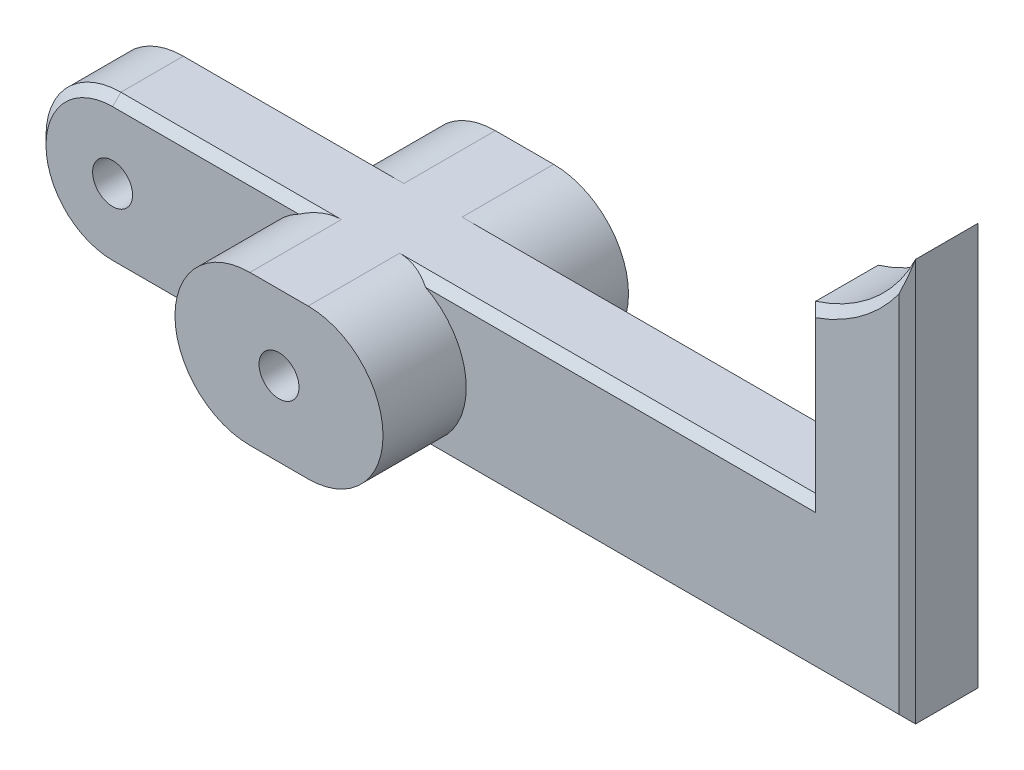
ISO-10303-21;
HEADER;
FILE_DESCRIPTION(('STEP AP214'),'2;1');
FILE_NAME('part.step','',(''),(''),'','','');
FILE_SCHEMA(('AUTOMOTIVE_DESIGN { 1 0 10303 214 1 1 1 1 }'));
ENDSEC;
DATA;
#1=APPLICATION_CONTEXT('core data for automotive mechanical design processes');
#2=APPLICATION_PROTOCOL_DEFINITION('international standard','automotive_design',2000,#1);
#3=PRODUCT_CONTEXT('',#1,'mechanical');
#4=PRODUCT('Part','Part','',(#3));
#5=PRODUCT_RELATED_PRODUCT_CATEGORY('part','',(#4));
#6=PRODUCT_DEFINITION_FORMATION('','',#4);
#7=PRODUCT_DEFINITION_CONTEXT('part definition',#1,'design');
#8=PRODUCT_DEFINITION('design','',#6,#7);
#9=PRODUCT_DEFINITION_SHAPE('','',#8);
#10=(LENGTH_UNIT() NAMED_UNIT(*) SI_UNIT(.MILLI.,.METRE.));
#11=(NAMED_UNIT(*) PLANE_ANGLE_UNIT() SI_UNIT($,.RADIAN.));
#12=(NAMED_UNIT(*) SI_UNIT($,.STERADIAN.) SOLID_ANGLE_UNIT());
#13=UNCERTAINTY_MEASURE_WITH_UNIT(LENGTH_MEASURE(1.E-05),#10,'distance_accuracy_value','');
#14=(GEOMETRIC_REPRESENTATION_CONTEXT(3) GLOBAL_UNCERTAINTY_ASSIGNED_CONTEXT((#13)) GLOBAL_UNIT_ASSIGNED_CONTEXT((#10,
#11,#12)) REPRESENTATION_CONTEXT('',''));
#15=CARTESIAN_POINT('',(0.,0.,0.));
#16=DIRECTION('',(0.,0.,1.));
#17=DIRECTION('',(1.,0.,0.));
#18=AXIS2_PLACEMENT_3D('',#15,#16,#17);
#19=CARTESIAN_POINT('',(96.5,67.0787840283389,4.75));
#20=DIRECTION('',(0.,0.,1.));
#21=DIRECTION('',(1.,0.,0.));
#22=AXIS2_PLACEMENT_3D('',#19,#20,#21);
#23=PLANE('',#22);
#24=CARTESIAN_POINT('',(19.,19.,4.75));
#25=DIRECTION('',(0.,0.,1.));
#26=DIRECTION('',(1.,0.,0.));
#27=AXIS2_PLACEMENT_3D('',#24,#25,#26);
#28=CIRCLE('',#27,2.4);
#29=CARTESIAN_POINT('',(21.4,19.,4.75));
#30=VERTEX_POINT('',#29);
#31=EDGE_CURVE('E264',#30,#30,#28,.T.);
#32=ORIENTED_EDGE('',*,*,#31,.F.);
#33=EDGE_LOOP('',(#32));
#34=FACE_BOUND('',#33,.T.);
#35=DIRECTION('',(1.,0.,0.));
#36=VECTOR('',#35,1.);
#37=CARTESIAN_POINT('',(114.5,11.,4.75));
#38=LINE('',#37,#36);
#39=CARTESIAN_POINT('',(19.,11.,4.75));
#40=VERTEX_POINT('',#39);
#41=CARTESIAN_POINT('',(41.3768943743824,11.,4.75));
#42=VERTEX_POINT('',#41);
#43=EDGE_CURVE('E359',#40,#42,#38,.T.);
#44=ORIENTED_EDGE('',*,*,#43,.T.);
#45=CARTESIAN_POINT('',(45.5,19.,4.75));
#46=DIRECTION('',(0.,0.,1.));
#47=DIRECTION('',(1.,0.,0.));
#48=AXIS2_PLACEMENT_3D('',#45,#46,#47);
#49=CIRCLE('',#48,9.);
#50=CARTESIAN_POINT('',(41.3768943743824,27.,4.75));
#51=VERTEX_POINT('',#50);
#52=EDGE_CURVE('E249',#42,#51,#49,.F.);
#53=ORIENTED_EDGE('',*,*,#52,.T.);
#54=DIRECTION('',(-1.,0.,0.));
#55=VECTOR('',#54,1.);
#56=CARTESIAN_POINT('',(19.,27.,4.75));
#57=LINE('',#56,#55);
#58=CARTESIAN_POINT('',(19.,27.,4.75));
#59=VERTEX_POINT('',#58);
#60=EDGE_CURVE('E344',#51,#59,#57,.T.);
#61=ORIENTED_EDGE('',*,*,#60,.T.);
#62=CARTESIAN_POINT('',(19.,19.,4.75));
#63=DIRECTION('',(0.,0.,1.));
#64=DIRECTION('',(1.,0.,0.));
#65=AXIS2_PLACEMENT_3D('',#62,#63,#64);
#66=CIRCLE('',#65,8.00000000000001);
#67=CARTESIAN_POINT('',(11.,19.,4.75));
#68=VERTEX_POINT('',#67);
#69=EDGE_CURVE('E354',#59,#68,#66,.T.);
#70=ORIENTED_EDGE('',*,*,#69,.T.);
#71=CARTESIAN_POINT('',(19.,19.,4.75));
#72=DIRECTION('',(0.,0.,1.));
#73=DIRECTION('',(1.,0.,0.));
#74=AXIS2_PLACEMENT_3D('',#71,#72,#73);
#75=CIRCLE('',#74,8.00000000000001);
#76=EDGE_CURVE('E356',#68,#40,#75,.T.);
#77=ORIENTED_EDGE('',*,*,#76,.T.);
#78=EDGE_LOOP('',(#44,#53,#61,#70,#77));
#79=FACE_BOUND('',#78,.T.);
#80=ADVANCED_FACE('F36',(#34,#79),#23,.T.);
#81=CARTESIAN_POINT('',(103.5,27.,4.75));
#82=VERTEX_POINT('',#81);
#83=CARTESIAN_POINT('',(56.6231056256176,27.,4.75));
#84=VERTEX_POINT('',#83);
#85=EDGE_CURVE('E345',#82,#84,#57,.T.);
#86=ORIENTED_EDGE('',*,*,#85,.T.);
#87=CARTESIAN_POINT('',(52.5,19.,4.75));
#88=DIRECTION('',(0.,0.,1.));
#89=DIRECTION('',(1.,0.,0.));
#90=AXIS2_PLACEMENT_3D('',#87,#88,#89);
#91=CIRCLE('',#90,9.);
#92=CARTESIAN_POINT('',(56.6231056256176,11.,4.75));
#93=VERTEX_POINT('',#92);
#94=EDGE_CURVE('E232',#84,#93,#91,.F.);
#95=ORIENTED_EDGE('',*,*,#94,.T.);
#96=CARTESIAN_POINT('',(113.5,11.,4.75));
#97=VERTEX_POINT('',#96);
#98=EDGE_CURVE('E358',#93,#97,#38,.T.);
#99=ORIENTED_EDGE('',*,*,#98,.T.);
#100=DIRECTION('',(0.,1.,0.));
#101=VECTOR('',#100,1.);
#102=CARTESIAN_POINT('',(113.5,58.3609861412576,4.75));
#103=LINE('',#102,#101);
#104=CARTESIAN_POINT('',(113.5,54.749956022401,4.75));
#105=VERTEX_POINT('',#104);
#106=EDGE_CURVE('E352',#97,#105,#103,.T.);
#107=ORIENTED_EDGE('',*,*,#106,.T.);
#108=CARTESIAN_POINT('',(96.5,67.0787840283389,4.75));
#109=DIRECTION('',(0.,0.,1.));
#110=DIRECTION('',(1.,0.,0.));
#111=AXIS2_PLACEMENT_3D('',#108,#109,#110);
#112=CIRCLE('',#111,21.);
#113=CARTESIAN_POINT('',(103.5,47.2797941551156,4.75));
#114=VERTEX_POINT('',#113);
#115=EDGE_CURVE('E350',#105,#114,#112,.F.);
#116=ORIENTED_EDGE('',*,*,#115,.T.);
#117=DIRECTION('',(0.,-1.,0.));
#118=VECTOR('',#117,1.);
#119=CARTESIAN_POINT('',(103.5,28.,4.75));
#120=LINE('',#119,#118);
#121=EDGE_CURVE('E348',#114,#82,#120,.T.);
#122=ORIENTED_EDGE('',*,*,#121,.T.);
#123=EDGE_LOOP('',(#86,#95,#99,#107,#116,#122));
#124=FACE_BOUND('',#123,.T.);
#125=ADVANCED_FACE('F496',(#124),#23,.T.);
#126=CARTESIAN_POINT('',(96.5,67.0787840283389,-4.75));
#127=DIRECTION('',(0.,0.,1.));
#128=DIRECTION('',(1.,0.,0.));
#129=AXIS2_PLACEMENT_3D('',#126,#127,#128);
#130=PLANE('',#129);
#131=CARTESIAN_POINT('',(19.,19.,-4.75));
#132=DIRECTION('',(0.,0.,1.));
#133=DIRECTION('',(1.,0.,0.));
#134=AXIS2_PLACEMENT_3D('',#131,#132,#133);
#135=CIRCLE('',#134,2.4);
#136=CARTESIAN_POINT('',(21.4,19.,-4.75));
#137=VERTEX_POINT('',#136);
#138=EDGE_CURVE('E268',#137,#137,#135,.T.);
#139=ORIENTED_EDGE('',*,*,#138,.T.);
#140=EDGE_LOOP('',(#139));
#141=FACE_BOUND('',#140,.T.);
#142=CARTESIAN_POINT('',(45.5,19.,-4.75));
#143=DIRECTION('',(0.,0.,1.));
#144=DIRECTION('',(1.,0.,0.));
#145=AXIS2_PLACEMENT_3D('',#142,#143,#144);
#146=CIRCLE('',#145,9.);
#147=CARTESIAN_POINT('',(41.3768943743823,11.,-4.75));
#148=VERTEX_POINT('',#147);
#149=CARTESIAN_POINT('',(41.3768943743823,27.,-4.75));
#150=VERTEX_POINT('',#149);
#151=EDGE_CURVE('E258',#148,#150,#146,.F.);
#152=ORIENTED_EDGE('',*,*,#151,.F.);
#153=DIRECTION('',(-1.,0.,0.));
#154=VECTOR('',#153,1.);
#155=CARTESIAN_POINT('',(96.5,11.,-4.75));
#156=LINE('',#155,#154);
#157=CARTESIAN_POINT('',(19.,11.,-4.75));
#158=VERTEX_POINT('',#157);
#159=EDGE_CURVE('E312',#148,#158,#156,.T.);
#160=ORIENTED_EDGE('',*,*,#159,.T.);
#161=CARTESIAN_POINT('',(19.,19.,-4.75));
#162=DIRECTION('',(0.,0.,1.));
#163=DIRECTION('',(1.,0.,0.));
#164=AXIS2_PLACEMENT_3D('',#161,#162,#163);
#165=CIRCLE('',#164,8.);
#166=CARTESIAN_POINT('',(11.,19.,-4.75));
#167=VERTEX_POINT('',#166);
#168=EDGE_CURVE('E310',#158,#167,#165,.F.);
#169=ORIENTED_EDGE('',*,*,#168,.T.);
#170=CARTESIAN_POINT('',(19.,19.,-4.75));
#171=DIRECTION('',(0.,0.,1.));
#172=DIRECTION('',(1.,0.,0.));
#173=AXIS2_PLACEMENT_3D('',#170,#171,#172);
#174=CIRCLE('',#173,8.);
#175=CARTESIAN_POINT('',(19.,27.,-4.75));
#176=VERTEX_POINT('',#175);
#177=EDGE_CURVE('E308',#167,#176,#174,.F.);
#178=ORIENTED_EDGE('',*,*,#177,.T.);
#179=DIRECTION('',(1.,0.,0.));
#180=VECTOR('',#179,1.);
#181=CARTESIAN_POINT('',(96.5,27.,-4.75));
#182=LINE('',#181,#180);
#183=EDGE_CURVE('E299',#176,#150,#182,.T.);
#184=ORIENTED_EDGE('',*,*,#183,.T.);
#185=EDGE_LOOP('',(#152,#160,#169,#178,#184));
#186=FACE_BOUND('',#185,.T.);
#187=ADVANCED_FACE('F557',(#141,#186),#130,.F.);
#188=CARTESIAN_POINT('',(52.5,19.,-4.75));
#189=DIRECTION('',(0.,0.,1.));
#190=DIRECTION('',(1.,0.,0.));
#191=AXIS2_PLACEMENT_3D('',#188,#189,#190);
#192=CIRCLE('',#191,9.);
#193=CARTESIAN_POINT('',(56.6231056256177,27.,-4.75));
#194=VERTEX_POINT('',#193);
#195=CARTESIAN_POINT('',(56.6231056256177,11.,-4.75));
#196=VERTEX_POINT('',#195);
#197=EDGE_CURVE('E52',#194,#196,#192,.F.);
#198=ORIENTED_EDGE('',*,*,#197,.F.);
#199=CARTESIAN_POINT('',(103.5,27.,-4.75));
#200=VERTEX_POINT('',#199);
#201=EDGE_CURVE('E298',#194,#200,#182,.T.);
#202=ORIENTED_EDGE('',*,*,#201,.T.);
#203=DIRECTION('',(0.,1.,0.));
#204=VECTOR('',#203,1.);
#205=CARTESIAN_POINT('',(103.5,67.0787840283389,-4.75));
#206=LINE('',#205,#204);
#207=CARTESIAN_POINT('',(103.5,47.2797941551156,-4.75));
#208=VERTEX_POINT('',#207);
#209=EDGE_CURVE('E302',#200,#208,#206,.T.);
#210=ORIENTED_EDGE('',*,*,#209,.T.);
#211=CARTESIAN_POINT('',(96.5,67.0787840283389,-4.75));
#212=DIRECTION('',(0.,0.,1.));
#213=DIRECTION('',(1.,0.,0.));
#214=AXIS2_PLACEMENT_3D('',#211,#212,#213);
#215=CIRCLE('',#214,21.);
#216=CARTESIAN_POINT('',(113.5,54.749956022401,-4.75));
#217=VERTEX_POINT('',#216);
#218=EDGE_CURVE('E304',#208,#217,#215,.T.);
#219=ORIENTED_EDGE('',*,*,#218,.T.);
#220=DIRECTION('',(0.,-1.,0.));
#221=VECTOR('',#220,1.);
#222=CARTESIAN_POINT('',(113.5,67.0787840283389,-4.75));
#223=LINE('',#222,#221);
#224=CARTESIAN_POINT('',(113.5,11.,-4.75));
#225=VERTEX_POINT('',#224);
#226=EDGE_CURVE('E306',#217,#225,#223,.T.);
#227=ORIENTED_EDGE('',*,*,#226,.T.);
#228=EDGE_CURVE('E313',#225,#196,#156,.T.);
#229=ORIENTED_EDGE('',*,*,#228,.T.);
#230=EDGE_LOOP('',(#198,#202,#210,#219,#227,#229));
#231=FACE_BOUND('',#230,.T.);
#232=ADVANCED_FACE('F566',(#231),#130,.F.);
#233=CARTESIAN_POINT('',(10.,28.,-3.75));
#234=DIRECTION('',(0.,-0.707106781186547,0.707106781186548));
#235=DIRECTION('',(-1.,0.,0.));
#236=AXIS2_PLACEMENT_3D('',#233,#234,#235);
#237=PLANE('',#236);
#238=DIRECTION('',(-1.,0.,0.));
#239=VECTOR('',#238,1.);
#240=CARTESIAN_POINT('',(10.,28.,-3.75));
#241=LINE('',#240,#239);
#242=CARTESIAN_POINT('',(45.5,28.,-3.75));
#243=VERTEX_POINT('',#242);
#244=CARTESIAN_POINT('',(19.,28.,-3.75));
#245=VERTEX_POINT('',#244);
#246=EDGE_CURVE('E340',#243,#245,#241,.T.);
#247=ORIENTED_EDGE('',*,*,#246,.F.);
#248=CARTESIAN_POINT('',(45.5,19.,-12.75));
#249=DIRECTION('',(0.,-0.707106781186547,0.707106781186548));
#250=DIRECTION('',(0.,-0.707106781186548,-0.707106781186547));
#251=AXIS2_PLACEMENT_3D('',#248,#249,#250);
#252=ELLIPSE('',#251,12.7279220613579,9.);
#253=EDGE_CURVE('E260',#243,#150,#252,.T.);
#254=ORIENTED_EDGE('',*,*,#253,.T.);
#255=ORIENTED_EDGE('',*,*,#183,.F.);
#256=DIRECTION('',(0.,-0.707106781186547,-0.707106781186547));
#257=VECTOR('',#256,1.);
#258=CARTESIAN_POINT('',(19.,28.,-3.75));
#259=LINE('',#258,#257);
#260=EDGE_CURVE('E419',#245,#176,#259,.T.);
#261=ORIENTED_EDGE('',*,*,#260,.F.);
#262=EDGE_LOOP('',(#247,#254,#255,#261));
#263=FACE_BOUND('',#262,.T.);
#264=ADVANCED_FACE('F604',(#263),#237,.F.);
#265=ORIENTED_EDGE('',*,*,#201,.F.);
#266=CARTESIAN_POINT('',(52.5,19.,-12.75));
#267=DIRECTION('',(0.,-0.707106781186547,0.707106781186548));
#268=DIRECTION('',(0.,-0.707106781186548,-0.707106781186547));
#269=AXIS2_PLACEMENT_3D('',#266,#267,#268);
#270=ELLIPSE('',#269,12.7279220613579,9.);
#271=CARTESIAN_POINT('',(52.5,28.,-3.75));
#272=VERTEX_POINT('',#271);
#273=EDGE_CURVE('E246',#194,#272,#270,.T.);
#274=ORIENTED_EDGE('',*,*,#273,.T.);
#275=CARTESIAN_POINT('',(102.5,28.,-3.75));
#276=VERTEX_POINT('',#275);
#277=EDGE_CURVE('E341',#276,#272,#241,.T.);
#278=ORIENTED_EDGE('',*,*,#277,.F.);
#279=DIRECTION('',(0.577350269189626,-0.577350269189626,-0.577350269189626));
#280=VECTOR('',#279,1.);
#281=CARTESIAN_POINT('',(95.8333333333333,34.6666666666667,2.91666666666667));
#282=LINE('',#281,#280);
#283=EDGE_CURVE('E292',#200,#276,#282,.F.);
#284=ORIENTED_EDGE('',*,*,#283,.F.);
#285=EDGE_LOOP('',(#265,#274,#278,#284));
#286=FACE_BOUND('',#285,.T.);
#287=ADVANCED_FACE('F597',(#286),#237,.F.);
#288=CARTESIAN_POINT('',(10.,10.,-3.75));
#289=DIRECTION('',(0.,0.707106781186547,0.707106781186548));
#290=DIRECTION('',(1.,0.,0.));
#291=AXIS2_PLACEMENT_3D('',#288,#289,#290);
#292=PLANE('',#291);
#293=ORIENTED_EDGE('',*,*,#159,.F.);
#294=CARTESIAN_POINT('',(45.5,19.,-12.75));
#295=DIRECTION('',(0.,0.707106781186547,0.707106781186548));
#296=DIRECTION('',(0.,0.707106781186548,-0.707106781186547));
#297=AXIS2_PLACEMENT_3D('',#294,#295,#296);
#298=ELLIPSE('',#297,12.7279220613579,9.);
#299=CARTESIAN_POINT('',(45.5,10.,-3.75000000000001));
#300=VERTEX_POINT('',#299);
#301=EDGE_CURVE('E255',#148,#300,#298,.T.);
#302=ORIENTED_EDGE('',*,*,#301,.T.);
#303=DIRECTION('',(1.,0.,0.));
#304=VECTOR('',#303,1.);
#305=CARTESIAN_POINT('',(10.,10.,-3.75));
#306=LINE('',#305,#304);
#307=CARTESIAN_POINT('',(19.,10.,-3.75));
#308=VERTEX_POINT('',#307);
#309=EDGE_CURVE('E296',#308,#300,#306,.T.);
#310=ORIENTED_EDGE('',*,*,#309,.F.);
#311=DIRECTION('',(0.,0.707106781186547,-0.707106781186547));
#312=VECTOR('',#311,1.);
#313=CARTESIAN_POINT('',(19.,10.,-3.75));
#314=LINE('',#313,#312);
#315=EDGE_CURVE('E365',#308,#158,#314,.T.);
#316=ORIENTED_EDGE('',*,*,#315,.T.);
#317=EDGE_LOOP('',(#293,#302,#310,#316));
#318=FACE_BOUND('',#317,.T.);
#319=ADVANCED_FACE('F593',(#318),#292,.F.);
#320=CARTESIAN_POINT('',(96.5,27.,4.75));
#321=DIRECTION('',(0.,0.707106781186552,0.707106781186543));
#322=DIRECTION('',(1.,0.,0.));
#323=AXIS2_PLACEMENT_3D('',#320,#321,#322);
#324=PLANE('',#323);
#325=ORIENTED_EDGE('',*,*,#60,.F.);
#326=CARTESIAN_POINT('',(45.5,19.,12.7500000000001));
#327=DIRECTION('',(0.,0.707106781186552,0.707106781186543));
#328=DIRECTION('',(0.,0.707106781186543,-0.707106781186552));
#329=AXIS2_PLACEMENT_3D('',#326,#327,#328);
#330=ELLIPSE('',#329,12.7279220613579,9.);
#331=CARTESIAN_POINT('',(45.5,28.,3.75));
#332=VERTEX_POINT('',#331);
#333=EDGE_CURVE('E252',#51,#332,#330,.F.);
#334=ORIENTED_EDGE('',*,*,#333,.T.);
#335=DIRECTION('',(1.,0.,0.));
#336=VECTOR('',#335,1.);
#337=CARTESIAN_POINT('',(102.5,28.,3.75));
#338=LINE('',#337,#336);
#339=CARTESIAN_POINT('',(19.,28.,3.75));
#340=VERTEX_POINT('',#339);
#341=EDGE_CURVE('E337',#340,#332,#338,.T.);
#342=ORIENTED_EDGE('',*,*,#341,.F.);
#343=DIRECTION('',(0.,0.707106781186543,-0.707106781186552));
#344=VECTOR('',#343,1.);
#345=CARTESIAN_POINT('',(19.,27.,4.75));
#346=LINE('',#345,#344);
#347=EDGE_CURVE('E476',#59,#340,#346,.T.);
#348=ORIENTED_EDGE('',*,*,#347,.F.);
#349=EDGE_LOOP('',(#325,#334,#342,#348));
#350=FACE_BOUND('',#349,.T.);
#351=ADVANCED_FACE('F39',(#350),#324,.T.);
#352=CARTESIAN_POINT('',(52.5,28.,3.75));
#353=VERTEX_POINT('',#352);
#354=CARTESIAN_POINT('',(102.5,28.,3.75));
#355=VERTEX_POINT('',#354);
#356=EDGE_CURVE('E336',#353,#355,#338,.T.);
#357=ORIENTED_EDGE('',*,*,#356,.F.);
#358=CARTESIAN_POINT('',(52.5,19.,12.7500000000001));
#359=DIRECTION('',(0.,0.707106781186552,0.707106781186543));
#360=DIRECTION('',(0.,0.707106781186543,-0.707106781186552));
#361=AXIS2_PLACEMENT_3D('',#358,#359,#360);
#362=ELLIPSE('',#361,12.7279220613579,9.);
#363=EDGE_CURVE('E236',#353,#84,#362,.F.);
#364=ORIENTED_EDGE('',*,*,#363,.T.);
#365=ORIENTED_EDGE('',*,*,#85,.F.);
#366=DIRECTION('',(-0.577350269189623,0.577350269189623,-0.577350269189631));
#367=VECTOR('',#366,1.);
#368=CARTESIAN_POINT('',(90.1404053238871,40.3595946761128,-8.60959467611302));
#369=LINE('',#368,#367);
#370=EDGE_CURVE('E366',#355,#82,#369,.F.);
#371=ORIENTED_EDGE('',*,*,#370,.F.);
#372=EDGE_LOOP('',(#357,#364,#365,#371));
#373=FACE_BOUND('',#372,.T.);
#374=ADVANCED_FACE('F506',(#373),#324,.T.);
#375=CARTESIAN_POINT('',(96.5,11.,4.75));
#376=DIRECTION('',(0.,-0.707106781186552,0.707106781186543));
#377=DIRECTION('',(-1.,0.,0.));
#378=AXIS2_PLACEMENT_3D('',#375,#376,#377);
#379=PLANE('',#378);
#380=DIRECTION('',(-1.,0.,0.));
#381=VECTOR('',#380,1.);
#382=CARTESIAN_POINT('',(19.,10.,3.75));
#383=LINE('',#382,#381);
#384=CARTESIAN_POINT('',(45.5,10.,3.75));
#385=VERTEX_POINT('',#384);
#386=CARTESIAN_POINT('',(19.,10.,3.75));
#387=VERTEX_POINT('',#386);
#388=EDGE_CURVE('E289',#385,#387,#383,.T.);
#389=ORIENTED_EDGE('',*,*,#388,.F.);
#390=CARTESIAN_POINT('',(45.5,19.,12.7500000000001));
#391=DIRECTION('',(0.,-0.707106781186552,0.707106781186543));
#392=DIRECTION('',(0.,-0.707106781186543,-0.707106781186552));
#393=AXIS2_PLACEMENT_3D('',#390,#391,#392);
#394=ELLIPSE('',#393,12.7279220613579,9.);
#395=EDGE_CURVE('E11',#385,#42,#394,.F.);
#396=ORIENTED_EDGE('',*,*,#395,.T.);
#397=ORIENTED_EDGE('',*,*,#43,.F.);
#398=DIRECTION('',(0.,-0.707106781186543,-0.707106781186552));
#399=VECTOR('',#398,1.);
#400=CARTESIAN_POINT('',(19.,11.,4.75));
#401=LINE('',#400,#399);
#402=EDGE_CURVE('E426',#40,#387,#401,.T.);
#403=ORIENTED_EDGE('',*,*,#402,.T.);
#404=EDGE_LOOP('',(#389,#396,#397,#403));
#405=FACE_BOUND('',#404,.T.);
#406=ADVANCED_FACE('F549',(#405),#379,.T.);
#407=CARTESIAN_POINT('',(10.,10.,4.75));
#408=DIRECTION('',(0.,1.,0.));
#409=DIRECTION('',(-1.,0.,0.));
#410=AXIS2_PLACEMENT_3D('',#407,#408,#409);
#411=PLANE('',#410);
#412=ORIENTED_EDGE('',*,*,#309,.T.);
#413=DIRECTION('',(0.,0.,-1.));
#414=VECTOR('',#413,1.);
#415=CARTESIAN_POINT('',(45.5,10.,14.75));
#416=LINE('',#415,#414);
#417=CARTESIAN_POINT('',(45.5,10.,-14.75));
#418=VERTEX_POINT('',#417);
#419=EDGE_CURVE('E233',#300,#418,#416,.T.);
#420=ORIENTED_EDGE('',*,*,#419,.T.);
#421=DIRECTION('',(1.,0.,0.));
#422=VECTOR('',#421,1.);
#423=CARTESIAN_POINT('',(45.5,10.,-14.75));
#424=LINE('',#423,#422);
#425=CARTESIAN_POINT('',(52.5,10.,-14.75));
#426=VERTEX_POINT('',#425);
#427=EDGE_CURVE('E525',#418,#426,#424,.T.);
#428=ORIENTED_EDGE('',*,*,#427,.T.);
#429=DIRECTION('',(0.,0.,-1.));
#430=VECTOR('',#429,1.);
#431=CARTESIAN_POINT('',(52.5,10.,14.75));
#432=LINE('',#431,#430);
#433=CARTESIAN_POINT('',(52.5,10.,-3.75));
#434=VERTEX_POINT('',#433);
#435=EDGE_CURVE('E514',#434,#426,#432,.T.);
#436=ORIENTED_EDGE('',*,*,#435,.F.);
#437=CARTESIAN_POINT('',(114.5,10.,-3.75));
#438=VERTEX_POINT('',#437);
#439=EDGE_CURVE('E295',#434,#438,#306,.T.);
#440=ORIENTED_EDGE('',*,*,#439,.T.);
#441=DIRECTION('',(0.,0.,-1.));
#442=VECTOR('',#441,1.);
#443=CARTESIAN_POINT('',(114.5,10.,4.75));
#444=LINE('',#443,#442);
#445=CARTESIAN_POINT('',(114.5,10.,3.75));
#446=VERTEX_POINT('',#445);
#447=EDGE_CURVE('E280',#446,#438,#444,.T.);
#448=ORIENTED_EDGE('',*,*,#447,.F.);
#449=CARTESIAN_POINT('',(52.5,10.,3.75));
#450=VERTEX_POINT('',#449);
#451=EDGE_CURVE('E293',#446,#450,#383,.T.);
#452=ORIENTED_EDGE('',*,*,#451,.T.);
#453=CARTESIAN_POINT('',(52.5,10.,14.75));
#454=VERTEX_POINT('',#453);
#455=EDGE_CURVE('E60',#454,#450,#432,.T.);
#456=ORIENTED_EDGE('',*,*,#455,.F.);
#457=DIRECTION('',(1.,0.,0.));
#458=VECTOR('',#457,1.);
#459=CARTESIAN_POINT('',(45.5,10.,14.75));
#460=LINE('',#459,#458);
#461=CARTESIAN_POINT('',(45.5,10.,14.75));
#462=VERTEX_POINT('',#461);
#463=EDGE_CURVE('E210',#462,#454,#460,.T.);
#464=ORIENTED_EDGE('',*,*,#463,.F.);
#465=EDGE_CURVE('E215',#462,#385,#416,.T.);
#466=ORIENTED_EDGE('',*,*,#465,.T.);
#467=ORIENTED_EDGE('',*,*,#388,.T.);
#468=DIRECTION('',(0.,0.,-1.));
#469=VECTOR('',#468,1.);
#470=CARTESIAN_POINT('',(19.,10.,4.75));
#471=LINE('',#470,#469);
#472=EDGE_CURVE('E283',#387,#308,#471,.T.);
#473=ORIENTED_EDGE('',*,*,#472,.T.);
#474=EDGE_LOOP('',(#412,#420,#428,#436,#440,#448,#452,#456,#464,#466,#467,#473));
#475=FACE_BOUND('',#474,.T.);
#476=ADVANCED_FACE('F213',(#475),#411,.F.);
#477=CARTESIAN_POINT('',(114.5,58.3609861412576,4.75));
#478=DIRECTION('',(-1.,0.,0.));
#479=DIRECTION('',(0.,0.,1.));
#480=AXIS2_PLACEMENT_3D('',#477,#478,#479);
#481=PLANE('',#480);
#482=ORIENTED_EDGE('',*,*,#447,.T.);
#483=DIRECTION('',(0.,1.,0.));
#484=VECTOR('',#483,1.);
#485=CARTESIAN_POINT('',(114.5,58.3609861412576,-3.75));
#486=LINE('',#485,#484);
#487=CARTESIAN_POINT('',(114.5,58.3609861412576,-3.75));
#488=VERTEX_POINT('',#487);
#489=EDGE_CURVE('E326',#438,#488,#486,.T.);
#490=ORIENTED_EDGE('',*,*,#489,.T.);
#491=DIRECTION('',(0.,0.,-1.));
#492=VECTOR('',#491,1.);
#493=CARTESIAN_POINT('',(114.5,58.3609861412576,4.75));
#494=LINE('',#493,#492);
#495=CARTESIAN_POINT('',(114.5,58.3609861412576,3.75));
#496=VERTEX_POINT('',#495);
#497=EDGE_CURVE('E277',#496,#488,#494,.T.);
#498=ORIENTED_EDGE('',*,*,#497,.F.);
#499=DIRECTION('',(0.,-1.,0.));
#500=VECTOR('',#499,1.);
#501=CARTESIAN_POINT('',(114.5,10.,3.75));
#502=LINE('',#501,#500);
#503=EDGE_CURVE('E324',#496,#446,#502,.T.);
#504=ORIENTED_EDGE('',*,*,#503,.T.);
#505=EDGE_LOOP('',(#482,#490,#498,#504));
#506=FACE_BOUND('',#505,.T.);
#507=ADVANCED_FACE('F488',(#506),#481,.F.);
#508=CARTESIAN_POINT('',(96.5,67.0787840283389,4.75));
#509=DIRECTION('',(0.,0.,-1.));
#510=DIRECTION('',(-1.,0.,0.));
#511=AXIS2_PLACEMENT_3D('',#508,#509,#510);
#512=CYLINDRICAL_SURFACE('',#511,20.);
#513=ORIENTED_EDGE('',*,*,#497,.T.);
#514=CARTESIAN_POINT('',(96.5,67.0787840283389,-3.75));
#515=DIRECTION('',(0.,0.,1.));
#516=DIRECTION('',(1.,0.,0.));
#517=AXIS2_PLACEMENT_3D('',#514,#515,#516);
#518=CIRCLE('',#517,20.);
#519=CARTESIAN_POINT('',(102.5,48.,-3.75));
#520=VERTEX_POINT('',#519);
#521=EDGE_CURVE('E330',#488,#520,#518,.F.);
#522=ORIENTED_EDGE('',*,*,#521,.T.);
#523=DIRECTION('',(0.,0.,-1.));
#524=VECTOR('',#523,1.);
#525=CARTESIAN_POINT('',(102.5,48.,4.75));
#526=LINE('',#525,#524);
#527=CARTESIAN_POINT('',(102.5,48.,3.75));
#528=VERTEX_POINT('',#527);
#529=EDGE_CURVE('E274',#528,#520,#526,.T.);
#530=ORIENTED_EDGE('',*,*,#529,.F.);
#531=CARTESIAN_POINT('',(96.5,67.0787840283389,3.75));
#532=DIRECTION('',(0.,0.,1.));
#533=DIRECTION('',(1.,0.,0.));
#534=AXIS2_PLACEMENT_3D('',#531,#532,#533);
#535=CIRCLE('',#534,20.);
#536=EDGE_CURVE('E328',#528,#496,#535,.T.);
#537=ORIENTED_EDGE('',*,*,#536,.T.);
#538=EDGE_LOOP('',(#513,#522,#530,#537));
#539=FACE_BOUND('',#538,.T.);
#540=ADVANCED_FACE('F573',(#539),#512,.F.);
#541=CARTESIAN_POINT('',(102.5,48.,4.75));
#542=DIRECTION('',(1.,0.,0.));
#543=DIRECTION('',(0.,0.,-1.));
#544=AXIS2_PLACEMENT_3D('',#541,#542,#543);
#545=PLANE('',#544);
#546=ORIENTED_EDGE('',*,*,#529,.T.);
#547=DIRECTION('',(0.,-1.,0.));
#548=VECTOR('',#547,1.);
#549=CARTESIAN_POINT('',(102.5,48.,-3.75));
#550=LINE('',#549,#548);
#551=EDGE_CURVE('E334',#520,#276,#550,.T.);
#552=ORIENTED_EDGE('',*,*,#551,.T.);
#553=DIRECTION('',(0.,0.,-1.));
#554=VECTOR('',#553,1.);
#555=CARTESIAN_POINT('',(102.5,28.,4.75));
#556=LINE('',#555,#554);
#557=EDGE_CURVE('E267',#355,#276,#556,.T.);
#558=ORIENTED_EDGE('',*,*,#557,.F.);
#559=DIRECTION('',(0.,1.,0.));
#560=VECTOR('',#559,1.);
#561=CARTESIAN_POINT('',(102.5,48.,3.75));
#562=LINE('',#561,#560);
#563=EDGE_CURVE('E332',#355,#528,#562,.T.);
#564=ORIENTED_EDGE('',*,*,#563,.T.);
#565=EDGE_LOOP('',(#546,#552,#558,#564));
#566=FACE_BOUND('',#565,.T.);
#567=ADVANCED_FACE('F570',(#566),#545,.F.);
#568=CARTESIAN_POINT('',(10.,28.,4.75));
#569=DIRECTION('',(0.,-1.,0.));
#570=DIRECTION('',(1.,0.,0.));
#571=AXIS2_PLACEMENT_3D('',#568,#569,#570);
#572=PLANE('',#571);
#573=ORIENTED_EDGE('',*,*,#277,.T.);
#574=DIRECTION('',(0.,0.,-1.));
#575=VECTOR('',#574,1.);
#576=CARTESIAN_POINT('',(52.5,28.,14.75));
#577=LINE('',#576,#575);
#578=CARTESIAN_POINT('',(52.5,28.,-14.75));
#579=VERTEX_POINT('',#578);
#580=EDGE_CURVE('E515',#272,#579,#577,.T.);
#581=ORIENTED_EDGE('',*,*,#580,.T.);
#582=DIRECTION('',(-1.,0.,0.));
#583=VECTOR('',#582,1.);
#584=CARTESIAN_POINT('',(45.5,28.,-14.75));
#585=LINE('',#584,#583);
#586=CARTESIAN_POINT('',(45.5,28.,-14.75));
#587=VERTEX_POINT('',#586);
#588=EDGE_CURVE('E229',#579,#587,#585,.T.);
#589=ORIENTED_EDGE('',*,*,#588,.T.);
#590=DIRECTION('',(0.,0.,-1.));
#591=VECTOR('',#590,1.);
#592=CARTESIAN_POINT('',(45.5,28.,14.75));
#593=LINE('',#592,#591);
#594=EDGE_CURVE('E519',#243,#587,#593,.T.);
#595=ORIENTED_EDGE('',*,*,#594,.F.);
#596=ORIENTED_EDGE('',*,*,#246,.T.);
#597=DIRECTION('',(0.,0.,-1.));
#598=VECTOR('',#597,1.);
#599=CARTESIAN_POINT('',(19.,28.,4.75));
#600=LINE('',#599,#598);
#601=EDGE_CURVE('E286',#245,#340,#600,.F.);
#602=ORIENTED_EDGE('',*,*,#601,.T.);
#603=ORIENTED_EDGE('',*,*,#341,.T.);
#604=CARTESIAN_POINT('',(45.5,28.,14.75));
#605=VERTEX_POINT('',#604);
#606=EDGE_CURVE('E516',#605,#332,#593,.T.);
#607=ORIENTED_EDGE('',*,*,#606,.F.);
#608=DIRECTION('',(-1.,0.,0.));
#609=VECTOR('',#608,1.);
#610=CARTESIAN_POINT('',(45.5,28.,14.75));
#611=LINE('',#610,#609);
#612=CARTESIAN_POINT('',(52.5,28.,14.75));
#613=VERTEX_POINT('',#612);
#614=EDGE_CURVE('E226',#613,#605,#611,.T.);
#615=ORIENTED_EDGE('',*,*,#614,.F.);
#616=EDGE_CURVE('E510',#613,#353,#577,.T.);
#617=ORIENTED_EDGE('',*,*,#616,.T.);
#618=ORIENTED_EDGE('',*,*,#356,.T.);
#619=ORIENTED_EDGE('',*,*,#557,.T.);
#620=EDGE_LOOP('',(#573,#581,#589,#595,#596,#602,#603,#607,#615,#617,#618,#619));
#621=FACE_BOUND('',#620,.T.);
#622=ADVANCED_FACE('F512',(#621),#572,.F.);
#623=CARTESIAN_POINT('',(19.,19.,4.75));
#624=DIRECTION('',(0.,0.,-1.));
#625=DIRECTION('',(-1.,0.,0.));
#626=AXIS2_PLACEMENT_3D('',#623,#624,#625);
#627=CYLINDRICAL_SURFACE('',#626,2.4);
#628=ORIENTED_EDGE('',*,*,#31,.T.);
#629=EDGE_LOOP('',(#628));
#630=FACE_BOUND('',#629,.T.);
#631=ORIENTED_EDGE('',*,*,#138,.F.);
#632=EDGE_LOOP('',(#631));
#633=FACE_BOUND('',#632,.T.);
#634=ADVANCED_FACE('F562',(#630,#633),#627,.F.);
#635=CARTESIAN_POINT('',(19.,19.,4.75));
#636=DIRECTION('',(0.,0.,-1.));
#637=DIRECTION('',(-1.,0.,0.));
#638=AXIS2_PLACEMENT_3D('',#635,#636,#637);
#639=CYLINDRICAL_SURFACE('',#638,9.);
#640=ORIENTED_EDGE('',*,*,#601,.F.);
#641=CARTESIAN_POINT('',(19.,19.,-3.75));
#642=DIRECTION('',(0.,0.,1.));
#643=DIRECTION('',(1.,0.,0.));
#644=AXIS2_PLACEMENT_3D('',#641,#642,#643);
#645=CIRCLE('',#644,9.);
#646=CARTESIAN_POINT('',(10.,19.,-3.75));
#647=VERTEX_POINT('',#646);
#648=EDGE_CURVE('E322',#245,#647,#645,.T.);
#649=ORIENTED_EDGE('',*,*,#648,.T.);
#650=DIRECTION('',(0.,0.,-1.));
#651=VECTOR('',#650,1.);
#652=CARTESIAN_POINT('',(10.,19.,4.75));
#653=LINE('',#652,#651);
#654=CARTESIAN_POINT('',(10.,19.,3.75));
#655=VERTEX_POINT('',#654);
#656=EDGE_CURVE('E271',#655,#647,#653,.T.);
#657=ORIENTED_EDGE('',*,*,#656,.F.);
#658=CARTESIAN_POINT('',(19.,19.,3.75));
#659=DIRECTION('',(0.,0.,1.));
#660=DIRECTION('',(1.,0.,0.));
#661=AXIS2_PLACEMENT_3D('',#658,#659,#660);
#662=CIRCLE('',#661,9.);
#663=EDGE_CURVE('E320',#655,#340,#662,.F.);
#664=ORIENTED_EDGE('',*,*,#663,.T.);
#665=EDGE_LOOP('',(#640,#649,#657,#664));
#666=FACE_BOUND('',#665,.T.);
#667=ADVANCED_FACE('F584',(#666),#639,.T.);
#668=CARTESIAN_POINT('',(19.,19.,4.75));
#669=DIRECTION('',(0.,0.,-1.));
#670=DIRECTION('',(-1.,0.,0.));
#671=AXIS2_PLACEMENT_3D('',#668,#669,#670);
#672=CYLINDRICAL_SURFACE('',#671,9.);
#673=ORIENTED_EDGE('',*,*,#656,.T.);
#674=CARTESIAN_POINT('',(19.,19.,-3.75));
#675=DIRECTION('',(0.,0.,1.));
#676=DIRECTION('',(1.,0.,0.));
#677=AXIS2_PLACEMENT_3D('',#674,#675,#676);
#678=CIRCLE('',#677,9.);
#679=EDGE_CURVE('E318',#647,#308,#678,.T.);
#680=ORIENTED_EDGE('',*,*,#679,.T.);
#681=ORIENTED_EDGE('',*,*,#472,.F.);
#682=CARTESIAN_POINT('',(19.,19.,3.75));
#683=DIRECTION('',(0.,0.,1.));
#684=DIRECTION('',(1.,0.,0.));
#685=AXIS2_PLACEMENT_3D('',#682,#683,#684);
#686=CIRCLE('',#685,9.);
#687=EDGE_CURVE('E316',#387,#655,#686,.F.);
#688=ORIENTED_EDGE('',*,*,#687,.T.);
#689=EDGE_LOOP('',(#673,#680,#681,#688));
#690=FACE_BOUND('',#689,.T.);
#691=ADVANCED_FACE('F409',(#690),#672,.T.);
#692=CARTESIAN_POINT('',(102.5,48.,-3.75));
#693=DIRECTION('',(0.707106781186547,0.,0.707106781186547));
#694=DIRECTION('',(0.,-1.,0.));
#695=AXIS2_PLACEMENT_3D('',#692,#693,#694);
#696=PLANE('',#695);
#697=ORIENTED_EDGE('',*,*,#283,.T.);
#698=ORIENTED_EDGE('',*,*,#551,.F.);
#699=CARTESIAN_POINT('',(102.5,48.,-3.75));
#700=CARTESIAN_POINT('',(102.666030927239,47.8782000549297,-3.91603092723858));
#701=CARTESIAN_POINT('',(102.832379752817,47.757282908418,-4.08237975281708));
#702=CARTESIAN_POINT('',(103.165713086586,47.5172142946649,-4.41571308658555));
#703=CARTESIAN_POINT('',(103.33269759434,47.3980628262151,-4.58269759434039));
#704=CARTESIAN_POINT('',(103.5,47.2797941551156,-4.74999999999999));
#705=B_SPLINE_CURVE_WITH_KNOTS('',3,(#699,#700,#701,#702,#703,#704),.UNSPECIFIED.,.F.,.F.,(4,2,
4),(0.,0.79352591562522,1.58705128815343),.UNSPECIFIED.);
#706=EDGE_CURVE('E412',#208,#520,#705,.F.);
#707=ORIENTED_EDGE('',*,*,#706,.F.);
#708=ORIENTED_EDGE('',*,*,#209,.F.);
#709=EDGE_LOOP('',(#697,#698,#707,#708));
#710=FACE_BOUND('',#709,.T.);
#711=ADVANCED_FACE('F401',(#710),#696,.F.);
#712=CARTESIAN_POINT('',(19.,19.,-4.75));
#713=DIRECTION('',(0.,0.,1.));
#714=DIRECTION('',(1.,0.,0.));
#715=AXIS2_PLACEMENT_3D('',#712,#713,#714);
#716=CONICAL_SURFACE('',#715,8.,0.785398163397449);
#717=ORIENTED_EDGE('',*,*,#260,.T.);
#718=ORIENTED_EDGE('',*,*,#177,.F.);
#719=DIRECTION('',(0.707106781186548,0.,-0.707106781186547));
#720=VECTOR('',#719,1.);
#721=CARTESIAN_POINT('',(10.,19.,-3.75));
#722=LINE('',#721,#720);
#723=EDGE_CURVE('E378',#647,#167,#722,.T.);
#724=ORIENTED_EDGE('',*,*,#723,.F.);
#725=ORIENTED_EDGE('',*,*,#648,.F.);
#726=EDGE_LOOP('',(#717,#718,#724,#725));
#727=FACE_BOUND('',#726,.T.);
#728=ADVANCED_FACE('F408',(#727),#716,.T.);
#729=CARTESIAN_POINT('',(96.5,67.0787840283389,-3.75));
#730=DIRECTION('',(0.,0.,-1.));
#731=DIRECTION('',(-1.,0.,0.));
#732=AXIS2_PLACEMENT_3D('',#729,#730,#731);
#733=CONICAL_SURFACE('',#732,20.,0.78539816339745);
#734=ORIENTED_EDGE('',*,*,#706,.T.);
#735=ORIENTED_EDGE('',*,*,#521,.F.);
#736=CARTESIAN_POINT('',(114.5,58.3609861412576,-3.75));
#737=CARTESIAN_POINT('',(114.429406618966,58.0532667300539,-3.8205933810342));
#738=CARTESIAN_POINT('',(114.355429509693,57.7471104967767,-3.89457049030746));
#739=CARTESIAN_POINT('',(114.201054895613,57.1383437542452,-4.04894510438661));
#740=CARTESIAN_POINT('',(114.120662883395,56.8357304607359,-4.12933711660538));
#741=CARTESIAN_POINT('',(113.953689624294,56.233963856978,-4.29631037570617));
#742=CARTESIAN_POINT('',(113.867108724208,55.9348103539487,-4.38289127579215));
#743=CARTESIAN_POINT('',(113.687961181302,55.3398082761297,-4.56203881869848));
#744=CARTESIAN_POINT('',(113.595389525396,55.0439627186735,-4.65461047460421));
#745=CARTESIAN_POINT('',(113.5,54.749956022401,-4.75));
#746=B_SPLINE_CURVE_WITH_KNOTS('',3,(#736,#737,#738,#739,#740,#741,#742,#743,#744,#745),
.UNSPECIFIED.,.F.,.F.,(4,2,2,2,4),(0.,0.970473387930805,1.94012457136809,2.90972146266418,
3.88014047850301),.UNSPECIFIED.);
#747=EDGE_CURVE('E369',#217,#488,#746,.F.);
#748=ORIENTED_EDGE('',*,*,#747,.F.);
#749=ORIENTED_EDGE('',*,*,#218,.F.);
#750=EDGE_LOOP('',(#734,#735,#748,#749));
#751=FACE_BOUND('',#750,.T.);
#752=ADVANCED_FACE('F381',(#751),#733,.F.);
#753=CARTESIAN_POINT('',(19.,19.,-4.75));
#754=DIRECTION('',(0.,0.,1.));
#755=DIRECTION('',(1.,0.,0.));
#756=AXIS2_PLACEMENT_3D('',#753,#754,#755);
#757=CONICAL_SURFACE('',#756,8.,0.785398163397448);
#758=ORIENTED_EDGE('',*,*,#723,.T.);
#759=ORIENTED_EDGE('',*,*,#168,.F.);
#760=ORIENTED_EDGE('',*,*,#315,.F.);
#761=ORIENTED_EDGE('',*,*,#679,.F.);
#762=EDGE_LOOP('',(#758,#759,#760,#761));
#763=FACE_BOUND('',#762,.T.);
#764=ADVANCED_FACE('F393',(#763),#757,.T.);
#765=CARTESIAN_POINT('',(114.5,58.3609861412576,-3.75));
#766=DIRECTION('',(-0.707106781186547,0.,0.707106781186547));
#767=DIRECTION('',(0.,1.,0.));
#768=AXIS2_PLACEMENT_3D('',#765,#766,#767);
#769=PLANE('',#768);
#770=ORIENTED_EDGE('',*,*,#747,.T.);
#771=ORIENTED_EDGE('',*,*,#489,.F.);
#772=DIRECTION('',(-0.577350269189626,0.577350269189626,-0.577350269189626));
#773=VECTOR('',#772,1.);
#774=CARTESIAN_POINT('',(98.3796712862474,26.1203287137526,-19.8703287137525));
#775=LINE('',#774,#773);
#776=EDGE_CURVE('E362',#225,#438,#775,.F.);
#777=ORIENTED_EDGE('',*,*,#776,.F.);
#778=ORIENTED_EDGE('',*,*,#226,.F.);
#779=EDGE_LOOP('',(#770,#771,#777,#778));
#780=FACE_BOUND('',#779,.T.);
#781=ADVANCED_FACE('F385',(#780),#769,.F.);
#782=ORIENTED_EDGE('',*,*,#439,.F.);
#783=CARTESIAN_POINT('',(52.5,19.,-12.75));
#784=DIRECTION('',(0.,0.707106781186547,0.707106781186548));
#785=DIRECTION('',(0.,0.707106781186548,-0.707106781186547));
#786=AXIS2_PLACEMENT_3D('',#783,#784,#785);
#787=ELLIPSE('',#786,12.7279220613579,9.);
#788=EDGE_CURVE('E243',#434,#196,#787,.T.);
#789=ORIENTED_EDGE('',*,*,#788,.T.);
#790=ORIENTED_EDGE('',*,*,#228,.F.);
#791=ORIENTED_EDGE('',*,*,#776,.T.);
#792=EDGE_LOOP('',(#782,#789,#790,#791));
#793=FACE_BOUND('',#792,.T.);
#794=ADVANCED_FACE('F392',(#793),#292,.F.);
#795=CARTESIAN_POINT('',(103.5,67.0787840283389,4.75));
#796=DIRECTION('',(-0.707106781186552,0.,0.707106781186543));
#797=DIRECTION('',(0.,1.,0.));
#798=AXIS2_PLACEMENT_3D('',#795,#796,#797);
#799=PLANE('',#798);
#800=ORIENTED_EDGE('',*,*,#370,.T.);
#801=ORIENTED_EDGE('',*,*,#121,.F.);
#802=CARTESIAN_POINT('',(103.5,47.2797941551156,4.75));
#803=CARTESIAN_POINT('',(103.33269759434,47.3980628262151,4.58269759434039));
#804=CARTESIAN_POINT('',(103.165713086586,47.517214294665,4.41571308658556));
#805=CARTESIAN_POINT('',(102.832379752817,47.757282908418,4.08237975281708));
#806=CARTESIAN_POINT('',(102.666030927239,47.8782000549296,3.91603092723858));
#807=CARTESIAN_POINT('',(102.5,48.,3.75));
#808=B_SPLINE_CURVE_WITH_KNOTS('',3,(#802,#803,#804,#805,#806,#807),.UNSPECIFIED.,.F.,.F.,(4,2,
4),(0.,0.793525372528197,1.58705128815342),.UNSPECIFIED.);
#809=EDGE_CURVE('E469',#528,#114,#808,.F.);
#810=ORIENTED_EDGE('',*,*,#809,.F.);
#811=ORIENTED_EDGE('',*,*,#563,.F.);
#812=EDGE_LOOP('',(#800,#801,#810,#811));
#813=FACE_BOUND('',#812,.T.);
#814=ADVANCED_FACE('F461',(#813),#799,.T.);
#815=CARTESIAN_POINT('',(19.,19.,4.75));
#816=DIRECTION('',(0.,0.,-1.));
#817=DIRECTION('',(-1.,0.,0.));
#818=AXIS2_PLACEMENT_3D('',#815,#816,#817);
#819=CONICAL_SURFACE('',#818,8.00000000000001,0.785398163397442);
#820=ORIENTED_EDGE('',*,*,#347,.T.);
#821=ORIENTED_EDGE('',*,*,#663,.F.);
#822=DIRECTION('',(-0.707106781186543,0.,-0.707106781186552));
#823=VECTOR('',#822,1.);
#824=CARTESIAN_POINT('',(11.,19.,4.75));
#825=LINE('',#824,#823);
#826=EDGE_CURVE('E438',#68,#655,#825,.T.);
#827=ORIENTED_EDGE('',*,*,#826,.F.);
#828=ORIENTED_EDGE('',*,*,#69,.F.);
#829=EDGE_LOOP('',(#820,#821,#827,#828));
#830=FACE_BOUND('',#829,.T.);
#831=ADVANCED_FACE('F467',(#830),#819,.T.);
#832=CARTESIAN_POINT('',(96.5,67.0787840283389,4.75));
#833=DIRECTION('',(0.,0.,1.));
#834=DIRECTION('',(1.,0.,0.));
#835=AXIS2_PLACEMENT_3D('',#832,#833,#834);
#836=CONICAL_SURFACE('',#835,21.,0.785398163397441);
#837=ORIENTED_EDGE('',*,*,#809,.T.);
#838=ORIENTED_EDGE('',*,*,#115,.F.);
#839=CARTESIAN_POINT('',(113.5,54.749956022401,4.75));
#840=CARTESIAN_POINT('',(113.595389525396,55.0439627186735,4.65461047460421));
#841=CARTESIAN_POINT('',(113.687961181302,55.3398082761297,4.56203881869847));
#842=CARTESIAN_POINT('',(113.867108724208,55.9348103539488,4.38289127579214));
#843=CARTESIAN_POINT('',(113.953689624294,56.233963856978,4.29631037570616));
#844=CARTESIAN_POINT('',(114.120662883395,56.835730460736,4.12933711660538));
#845=CARTESIAN_POINT('',(114.201054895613,57.1383437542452,4.04894510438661));
#846=CARTESIAN_POINT('',(114.355429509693,57.7471104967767,3.89457049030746));
#847=CARTESIAN_POINT('',(114.429406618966,58.0532667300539,3.82059338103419));
#848=CARTESIAN_POINT('',(114.5,58.3609861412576,3.75));
#849=B_SPLINE_CURVE_WITH_KNOTS('',3,(#839,#840,#841,#842,#843,#844,#845,#846,#847,#848),
.UNSPECIFIED.,.F.,.F.,(4,2,2,2,4),(0.,0.970419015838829,1.9400159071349,2.90966709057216,
3.88014047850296),.UNSPECIFIED.);
#850=EDGE_CURVE('E429',#496,#105,#849,.F.);
#851=ORIENTED_EDGE('',*,*,#850,.F.);
#852=ORIENTED_EDGE('',*,*,#536,.F.);
#853=EDGE_LOOP('',(#837,#838,#851,#852));
#854=FACE_BOUND('',#853,.T.);
#855=ADVANCED_FACE('F441',(#854),#836,.F.);
#856=CARTESIAN_POINT('',(19.,19.,4.75));
#857=DIRECTION('',(0.,0.,-1.));
#858=DIRECTION('',(-1.,0.,0.));
#859=AXIS2_PLACEMENT_3D('',#856,#857,#858);
#860=CONICAL_SURFACE('',#859,8.00000000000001,0.785398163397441);
#861=ORIENTED_EDGE('',*,*,#826,.T.);
#862=ORIENTED_EDGE('',*,*,#687,.F.);
#863=ORIENTED_EDGE('',*,*,#402,.F.);
#864=ORIENTED_EDGE('',*,*,#76,.F.);
#865=EDGE_LOOP('',(#861,#862,#863,#864));
#866=FACE_BOUND('',#865,.T.);
#867=ADVANCED_FACE('F453',(#866),#860,.T.);
#868=CARTESIAN_POINT('',(113.5,67.0787840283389,4.75));
#869=DIRECTION('',(0.707106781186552,0.,0.707106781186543));
#870=DIRECTION('',(0.,-1.,0.));
#871=AXIS2_PLACEMENT_3D('',#868,#869,#870);
#872=PLANE('',#871);
#873=ORIENTED_EDGE('',*,*,#850,.T.);
#874=ORIENTED_EDGE('',*,*,#106,.F.);
#875=DIRECTION('',(0.577350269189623,-0.577350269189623,-0.577350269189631));
#876=VECTOR('',#875,1.);
#877=CARTESIAN_POINT('',(94.8070719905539,29.6929280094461,23.4429280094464));
#878=LINE('',#877,#876);
#879=EDGE_CURVE('E263',#446,#97,#878,.F.);
#880=ORIENTED_EDGE('',*,*,#879,.F.);
#881=ORIENTED_EDGE('',*,*,#503,.F.);
#882=EDGE_LOOP('',(#873,#874,#880,#881));
#883=FACE_BOUND('',#882,.T.);
#884=ADVANCED_FACE('F445',(#883),#872,.T.);
#885=ORIENTED_EDGE('',*,*,#98,.F.);
#886=CARTESIAN_POINT('',(52.5,19.,12.7500000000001));
#887=DIRECTION('',(0.,-0.707106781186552,0.707106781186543));
#888=DIRECTION('',(0.,-0.707106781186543,-0.707106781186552));
#889=AXIS2_PLACEMENT_3D('',#886,#887,#888);
#890=ELLIPSE('',#889,12.7279220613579,9.);
#891=EDGE_CURVE('E45',#93,#450,#890,.F.);
#892=ORIENTED_EDGE('',*,*,#891,.T.);
#893=ORIENTED_EDGE('',*,*,#451,.F.);
#894=ORIENTED_EDGE('',*,*,#879,.T.);
#895=EDGE_LOOP('',(#885,#892,#893,#894));
#896=FACE_BOUND('',#895,.T.);
#897=ADVANCED_FACE('F452',(#896),#379,.T.);
#898=CARTESIAN_POINT('',(45.5,19.,14.75));
#899=DIRECTION('',(0.,0.,1.));
#900=DIRECTION('',(1.,0.,0.));
#901=AXIS2_PLACEMENT_3D('',#898,#899,#900);
#902=PLANE('',#901);
#903=CARTESIAN_POINT('',(45.5,19.,14.75));
#904=DIRECTION('',(0.,0.,1.));
#905=DIRECTION('',(1.,0.,0.));
#906=AXIS2_PLACEMENT_3D('',#903,#904,#905);
#907=CIRCLE('',#906,9.);
#908=EDGE_CURVE('E220',#605,#462,#907,.T.);
#909=ORIENTED_EDGE('',*,*,#908,.T.);
#910=ORIENTED_EDGE('',*,*,#463,.T.);
#911=CARTESIAN_POINT('',(52.5,19.,14.75));
#912=DIRECTION('',(0.,0.,1.));
#913=DIRECTION('',(1.,0.,0.));
#914=AXIS2_PLACEMENT_3D('',#911,#912,#913);
#915=CIRCLE('',#914,9.);
#916=EDGE_CURVE('E219',#454,#613,#915,.T.);
#917=ORIENTED_EDGE('',*,*,#916,.T.);
#918=ORIENTED_EDGE('',*,*,#614,.T.);
#919=EDGE_LOOP('',(#909,#910,#917,#918));
#920=FACE_BOUND('',#919,.T.);
#921=CARTESIAN_POINT('',(49.,19.,14.75));
#922=DIRECTION('',(0.,0.,1.));
#923=DIRECTION('',(1.,0.,0.));
#924=AXIS2_PLACEMENT_3D('',#921,#922,#923);
#925=CIRCLE('',#924,2.4);
#926=CARTESIAN_POINT('',(51.4,19.,14.75));
#927=VERTEX_POINT('',#926);
#928=EDGE_CURVE('E531',#927,#927,#925,.T.);
#929=ORIENTED_EDGE('',*,*,#928,.F.);
#930=EDGE_LOOP('',(#929));
#931=FACE_BOUND('',#930,.T.);
#932=ADVANCED_FACE('F223',(#920,#931),#902,.T.);
#933=CARTESIAN_POINT('',(52.5,19.,14.75));
#934=DIRECTION('',(0.,0.,-1.));
#935=DIRECTION('',(-1.,0.,0.));
#936=AXIS2_PLACEMENT_3D('',#933,#934,#935);
#937=CYLINDRICAL_SURFACE('',#936,9.);
#938=ORIENTED_EDGE('',*,*,#363,.F.);
#939=ORIENTED_EDGE('',*,*,#616,.F.);
#940=ORIENTED_EDGE('',*,*,#916,.F.);
#941=ORIENTED_EDGE('',*,*,#455,.T.);
#942=ORIENTED_EDGE('',*,*,#891,.F.);
#943=ORIENTED_EDGE('',*,*,#94,.F.);
#944=EDGE_LOOP('',(#938,#939,#940,#941,#942,#943));
#945=FACE_BOUND('',#944,.T.);
#946=ADVANCED_FACE('F509',(#945),#937,.T.);
#947=CARTESIAN_POINT('',(45.5,19.,14.75));
#948=DIRECTION('',(0.,0.,-1.));
#949=DIRECTION('',(-1.,0.,0.));
#950=AXIS2_PLACEMENT_3D('',#947,#948,#949);
#951=CYLINDRICAL_SURFACE('',#950,9.);
#952=ORIENTED_EDGE('',*,*,#333,.F.);
#953=ORIENTED_EDGE('',*,*,#52,.F.);
#954=ORIENTED_EDGE('',*,*,#395,.F.);
#955=ORIENTED_EDGE('',*,*,#465,.F.);
#956=ORIENTED_EDGE('',*,*,#908,.F.);
#957=ORIENTED_EDGE('',*,*,#606,.T.);
#958=EDGE_LOOP('',(#952,#953,#954,#955,#956,#957));
#959=FACE_BOUND('',#958,.T.);
#960=ADVANCED_FACE('F231',(#959),#951,.T.);
#961=ORIENTED_EDGE('',*,*,#253,.F.);
#962=ORIENTED_EDGE('',*,*,#594,.T.);
#963=CARTESIAN_POINT('',(45.5,19.,-14.75));
#964=DIRECTION('',(0.,0.,1.));
#965=DIRECTION('',(1.,0.,0.));
#966=AXIS2_PLACEMENT_3D('',#963,#964,#965);
#967=CIRCLE('',#966,9.);
#968=EDGE_CURVE('E528',#587,#418,#967,.T.);
#969=ORIENTED_EDGE('',*,*,#968,.T.);
#970=ORIENTED_EDGE('',*,*,#419,.F.);
#971=ORIENTED_EDGE('',*,*,#301,.F.);
#972=ORIENTED_EDGE('',*,*,#151,.T.);
#973=EDGE_LOOP('',(#961,#962,#969,#970,#971,#972));
#974=FACE_BOUND('',#973,.T.);
#975=ADVANCED_FACE('F615',(#974),#951,.T.);
#976=ORIENTED_EDGE('',*,*,#273,.F.);
#977=ORIENTED_EDGE('',*,*,#197,.T.);
#978=ORIENTED_EDGE('',*,*,#788,.F.);
#979=ORIENTED_EDGE('',*,*,#435,.T.);
#980=CARTESIAN_POINT('',(52.5,19.,-14.75));
#981=DIRECTION('',(0.,0.,1.));
#982=DIRECTION('',(1.,0.,0.));
#983=AXIS2_PLACEMENT_3D('',#980,#981,#982);
#984=CIRCLE('',#983,9.);
#985=EDGE_CURVE('E522',#426,#579,#984,.T.);
#986=ORIENTED_EDGE('',*,*,#985,.T.);
#987=ORIENTED_EDGE('',*,*,#580,.F.);
#988=EDGE_LOOP('',(#976,#977,#978,#979,#986,#987));
#989=FACE_BOUND('',#988,.T.);
#990=ADVANCED_FACE('F548',(#989),#937,.T.);
#991=CARTESIAN_POINT('',(45.5,19.,-14.75));
#992=DIRECTION('',(0.,0.,1.));
#993=DIRECTION('',(1.,0.,0.));
#994=AXIS2_PLACEMENT_3D('',#991,#992,#993);
#995=PLANE('',#994);
#996=ORIENTED_EDGE('',*,*,#968,.F.);
#997=ORIENTED_EDGE('',*,*,#588,.F.);
#998=ORIENTED_EDGE('',*,*,#985,.F.);
#999=ORIENTED_EDGE('',*,*,#427,.F.);
#1000=EDGE_LOOP('',(#996,#997,#998,#999));
#1001=FACE_BOUND('',#1000,.T.);
#1002=CARTESIAN_POINT('',(49.,19.,-14.75));
#1003=DIRECTION('',(0.,0.,1.));
#1004=DIRECTION('',(1.,0.,0.));
#1005=AXIS2_PLACEMENT_3D('',#1002,#1003,#1004);
#1006=CIRCLE('',#1005,2.4);
#1007=CARTESIAN_POINT('',(51.4,19.,-14.75));
#1008=VERTEX_POINT('',#1007);
#1009=EDGE_CURVE('E534',#1008,#1008,#1006,.T.);
#1010=ORIENTED_EDGE('',*,*,#1009,.T.);
#1011=EDGE_LOOP('',(#1010));
#1012=FACE_BOUND('',#1011,.T.);
#1013=ADVANCED_FACE('F667',(#1001,#1012),#995,.F.);
#1014=CARTESIAN_POINT('',(49.,19.,4.75));
#1015=DIRECTION('',(0.,0.,-1.));
#1016=DIRECTION('',(-1.,0.,0.));
#1017=AXIS2_PLACEMENT_3D('',#1014,#1015,#1016);
#1018=CYLINDRICAL_SURFACE('',#1017,2.4);
#1019=ORIENTED_EDGE('',*,*,#1009,.F.);
#1020=EDGE_LOOP('',(#1019));
#1021=FACE_BOUND('',#1020,.T.);
#1022=ORIENTED_EDGE('',*,*,#928,.T.);
#1023=EDGE_LOOP('',(#1022));
#1024=FACE_BOUND('',#1023,.T.);
#1025=ADVANCED_FACE('F540',(#1021,#1024),#1018,.F.);
#1026=CLOSED_SHELL('',(#80,#125,#187,#232,#264,#287,#319,#351,#374,#406,#476,#507,#540,#567,
#622,#634,#667,#691,#711,#728,#752,#764,#781,#794,#814,#831,#855,#867,#884,#897,#932,#946,#960,
#975,#990,#1013,#1025));
#1027=MANIFOLD_SOLID_BREP('B2',#1026);
#1028=ADVANCED_BREP_SHAPE_REPRESENTATION('',(#18,#1027),#14);
#1029=SHAPE_DEFINITION_REPRESENTATION(#9,#1028);
ENDSEC;
END-ISO-10303-21;
